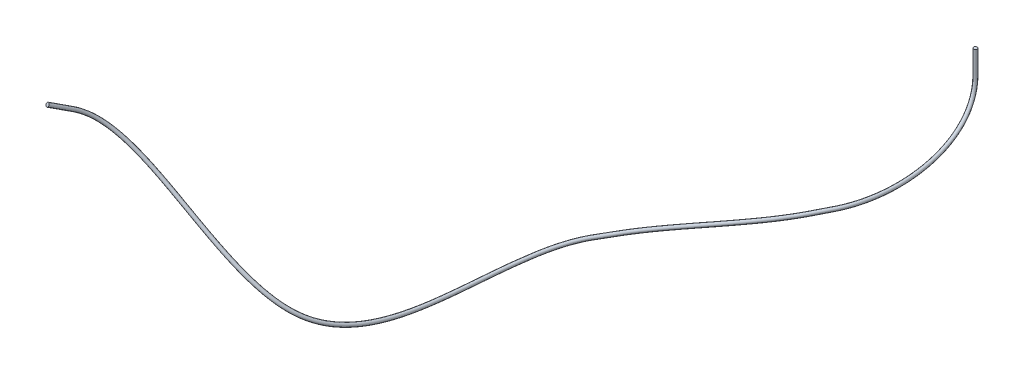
ISO-10303-21;
HEADER;
FILE_DESCRIPTION(('STEP AP214'),'2;1');
FILE_NAME('part.step','',(''),(''),'','','');
FILE_SCHEMA(('AUTOMOTIVE_DESIGN { 1 0 10303 214 1 1 1 1 }'));
ENDSEC;
DATA;
#1=APPLICATION_CONTEXT('core data for automotive mechanical design processes');
#2=APPLICATION_PROTOCOL_DEFINITION('international standard','automotive_design',2000,#1);
#3=PRODUCT_CONTEXT('',#1,'mechanical');
#4=PRODUCT('Part','Part','',(#3));
#5=PRODUCT_RELATED_PRODUCT_CATEGORY('part','',(#4));
#6=PRODUCT_DEFINITION_FORMATION('','',#4);
#7=PRODUCT_DEFINITION_CONTEXT('part definition',#1,'design');
#8=PRODUCT_DEFINITION('design','',#6,#7);
#9=PRODUCT_DEFINITION_SHAPE('','',#8);
#10=(LENGTH_UNIT() NAMED_UNIT(*) SI_UNIT(.MILLI.,.METRE.));
#11=(NAMED_UNIT(*) PLANE_ANGLE_UNIT() SI_UNIT($,.RADIAN.));
#12=(NAMED_UNIT(*) SI_UNIT($,.STERADIAN.) SOLID_ANGLE_UNIT());
#13=UNCERTAINTY_MEASURE_WITH_UNIT(LENGTH_MEASURE(1.E-05),#10,'distance_accuracy_value','');
#14=(GEOMETRIC_REPRESENTATION_CONTEXT(3) GLOBAL_UNCERTAINTY_ASSIGNED_CONTEXT((#13)) GLOBAL_UNIT_ASSIGNED_CONTEXT((#10,
#11,#12)) REPRESENTATION_CONTEXT('',''));
#15=CARTESIAN_POINT('',(0.,0.,0.));
#16=DIRECTION('',(0.,0.,1.));
#17=DIRECTION('',(1.,0.,0.));
#18=AXIS2_PLACEMENT_3D('',#15,#16,#17);
#19=CARTESIAN_POINT('',(129.032,35.2425,13.3985));
#20=DIRECTION('',(0.,-1.,0.));
#21=DIRECTION('',(1.,0.,0.));
#22=AXIS2_PLACEMENT_3D('',#19,#20,#21);
#23=PLANE('',#22);
#24=CARTESIAN_POINT('',(129.845000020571,35.2425,13.3985));
#25=CARTESIAN_POINT('',(129.845000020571,35.2425,13.8241858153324));
#26=CARTESIAN_POINT('',(129.457685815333,35.2425,14.2115000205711));
#27=CARTESIAN_POINT('',(128.606314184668,35.2425,14.2115000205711));
#28=CARTESIAN_POINT('',(128.218999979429,35.2425,13.8241858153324));
#29=CARTESIAN_POINT('',(128.218999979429,35.2425,12.9728141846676));
#30=CARTESIAN_POINT('',(128.606314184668,35.2425,12.585499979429));
#31=CARTESIAN_POINT('',(129.457685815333,35.2425,12.585499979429));
#32=CARTESIAN_POINT('',(129.845000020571,35.2425,12.9728141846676));
#33=CARTESIAN_POINT('',(129.845000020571,35.2425,13.3985));
#34=B_SPLINE_CURVE_WITH_KNOTS('',3,(#24,#25,#26,#27,#28,#29,#30,#31,#32,#33),.UNSPECIFIED.,.T.,
.F.,(4,2,2,2,4),(0.,0.25,0.5,0.75,1.),.UNSPECIFIED.);
#35=CARTESIAN_POINT('',(129.845000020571,35.2425,13.3985));
#36=VERTEX_POINT('',#35);
#37=EDGE_CURVE('E24',#36,#36,#34,.T.);
#38=ORIENTED_EDGE('',*,*,#37,.F.);
#39=EDGE_LOOP('',(#38));
#40=FACE_BOUND('',#39,.T.);
#41=ADVANCED_FACE('F14',(#40),#23,.F.);
#42=CARTESIAN_POINT('',(-8.90778368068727,81.1206105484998,286.540515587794));
#43=DIRECTION('',(-0.27533615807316,0.453990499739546,0.847397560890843));
#44=DIRECTION('',(0.892316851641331,0.448681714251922,0.049551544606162));
#45=AXIS2_PLACEMENT_3D('',#42,#43,#44);
#46=PLANE('',#45);
#47=CARTESIAN_POINT('',(-8.18233006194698,81.4853887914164,286.580800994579));
#48=CARTESIAN_POINT('',(-8.03005549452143,81.1576999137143,286.805836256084));
#49=CARTESIAN_POINT('',(-8.23711405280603,80.6857683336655,286.991394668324));
#50=CARTESIAN_POINT('',(-8.99680730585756,80.3037734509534,286.949207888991));
#51=CARTESIAN_POINT('',(-9.48096273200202,80.428143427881,286.725265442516));
#52=CARTESIAN_POINT('',(-9.78551186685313,81.0835211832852,286.275194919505));
#53=CARTESIAN_POINT('',(-9.57845330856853,81.555452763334,286.089636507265));
#54=CARTESIAN_POINT('',(-8.818760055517,81.9374476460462,286.131823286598));
#55=CARTESIAN_POINT('',(-8.33460462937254,81.8130776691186,286.355765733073));
#56=CARTESIAN_POINT('',(-8.18233006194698,81.4853887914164,286.580800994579));
#57=B_SPLINE_CURVE_WITH_KNOTS('',3,(#47,#48,#49,#50,#51,#52,#53,#54,#55,#56),.UNSPECIFIED.,.T.,
.F.,(4,2,2,2,4),(0.,0.25,0.5,0.75,1.),.UNSPECIFIED.);
#58=CARTESIAN_POINT('',(-8.18233006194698,81.4853887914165,286.580800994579));
#59=VERTEX_POINT('',#58);
#60=EDGE_CURVE('E9',#59,#59,#57,.F.);
#61=ORIENTED_EDGE('',*,*,#60,.T.);
#62=EDGE_LOOP('',(#61));
#63=FACE_BOUND('',#62,.T.);
#64=ADVANCED_FACE('F32',(#63),#46,.T.);
#65=CARTESIAN_POINT('',(129.845000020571,35.2425,13.3985));
#66=CARTESIAN_POINT('',(129.845000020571,31.9184242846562,13.3984999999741));
#67=CARTESIAN_POINT('',(129.844990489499,28.5696958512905,13.3918134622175));
#68=CARTESIAN_POINT('',(129.845017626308,19.0748861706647,13.4108513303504));
#69=CARTESIAN_POINT('',(130.49475792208,14.8275689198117,15.9784224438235));
#70=CARTESIAN_POINT('',(132.105649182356,8.80960138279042,24.3035892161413));
#71=CARTESIAN_POINT('',(133.010800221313,7.18038857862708,30.1169549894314));
#72=CARTESIAN_POINT('',(135.001109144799,4.14185856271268,49.4901921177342));
#73=CARTESIAN_POINT('',(135.116356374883,5.22004630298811,65.4572993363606));
#74=CARTESIAN_POINT('',(128.424413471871,5.22006576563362,78.59125511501));
#75=CARTESIAN_POINT('',(127.2657524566,5.22006243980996,80.8652239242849));
#76=CARTESIAN_POINT('',(116.737003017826,5.22006243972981,101.528911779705));
#77=CARTESIAN_POINT('',(101.124111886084,5.22006243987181,116.238828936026));
#78=CARTESIAN_POINT('',(89.7231080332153,5.22006243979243,135.985832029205));
#79=CARTESIAN_POINT('',(88.3400788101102,5.22006540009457,138.381294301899));
#80=CARTESIAN_POINT('',(82.9193495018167,5.22005173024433,147.770398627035));
#81=CARTESIAN_POINT('',(80.5722551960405,4.68791333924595,156.781916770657));
#82=CARTESIAN_POINT('',(77.226078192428,3.74845837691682,176.103929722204));
#83=CARTESIAN_POINT('',(76.2758880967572,3.33780127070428,186.368311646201));
#84=CARTESIAN_POINT('',(72.9926770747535,3.72042020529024,215.791848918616));
#85=CARTESIAN_POINT('',(70.2545285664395,6.05190228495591,233.86201570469));
#86=CARTESIAN_POINT('',(52.3359544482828,21.3263417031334,253.301847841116));
#87=CARTESIAN_POINT('',(38.4651258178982,33.1595884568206,255.867974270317));
#88=CARTESIAN_POINT('',(18.4463804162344,51.3709551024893,260.432166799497));
#89=CARTESIAN_POINT('',(11.9227226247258,57.5052890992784,262.066213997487));
#90=CARTESIAN_POINT('',(1.03209247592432,68.5653372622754,267.679776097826));
#91=CARTESIAN_POINT('',(-3.31142291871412,73.4539993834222,271.589896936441));
#92=CARTESIAN_POINT('',(-6.27504136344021,78.3405187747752,280.710687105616));
#93=CARTESIAN_POINT('',(-7.26828583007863,79.9782587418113,283.767662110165));
#94=CARTESIAN_POINT('',(-8.18233006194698,81.4853887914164,286.580800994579));
#95=CARTESIAN_POINT('',(129.845000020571,35.2425,13.8241858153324));
#96=CARTESIAN_POINT('',(129.845000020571,31.9424380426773,13.8241858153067));
#97=CARTESIAN_POINT('',(129.848472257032,28.5377223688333,13.8175000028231));
#98=CARTESIAN_POINT('',(129.838586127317,19.1339473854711,13.8365358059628));
#99=CARTESIAN_POINT('',(130.448811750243,15.100010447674,16.3196697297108));
#100=CARTESIAN_POINT('',(131.975836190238,9.19059091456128,24.4790335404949));
#101=CARTESIAN_POINT('',(132.783944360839,7.52293417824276,30.2354749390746));
#102=CARTESIAN_POINT('',(134.752976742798,4.49710087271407,49.4897885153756));
#103=CARTESIAN_POINT('',(134.885719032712,5.5719131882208,65.3822335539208));
#104=CARTESIAN_POINT('',(128.214485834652,5.57193256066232,78.4755426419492));
#105=CARTESIAN_POINT('',(127.050708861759,5.57192925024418,80.7595523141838));
#106=CARTESIAN_POINT('',(116.536307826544,5.57192925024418,101.395080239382));
#107=CARTESIAN_POINT('',(100.928958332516,5.57192925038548,116.097686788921));
#108=CARTESIAN_POINT('',(89.5141041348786,5.57192925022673,135.868679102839));
#109=CARTESIAN_POINT('',(88.1369578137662,5.57193223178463,138.253951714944));
#110=CARTESIAN_POINT('',(82.6960923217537,5.57191846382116,147.677933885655));
#111=CARTESIAN_POINT('',(80.3316317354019,5.03733056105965,156.745029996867));
#112=CARTESIAN_POINT('',(76.9813776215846,4.09673843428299,176.090689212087));
#113=CARTESIAN_POINT('',(76.0319392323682,3.68662327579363,186.352156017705));
#114=CARTESIAN_POINT('',(72.7539464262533,4.06868308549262,215.729472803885));
#115=CARTESIAN_POINT('',(70.0105554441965,6.40800215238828,233.673722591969));
#116=CARTESIAN_POINT('',(52.3172313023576,21.4904303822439,252.869181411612));
#117=CARTESIAN_POINT('',(38.4927174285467,33.2825705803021,255.461329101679));
#118=CARTESIAN_POINT('',(18.4672404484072,51.5000483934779,260.027052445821));
#119=CARTESIAN_POINT('',(11.9301595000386,57.646043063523,261.661661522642));
#120=CARTESIAN_POINT('',(0.975934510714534,68.7706447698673,267.307990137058));
#121=CARTESIAN_POINT('',(-3.44680870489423,73.7538418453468,271.312886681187));
#122=CARTESIAN_POINT('',(-6.43408728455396,78.6793723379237,280.506490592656));
#123=CARTESIAN_POINT('',(-7.41547502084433,80.2975625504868,283.526975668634));
#124=CARTESIAN_POINT('',(-8.33460462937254,81.8130776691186,286.355765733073));
#125=CARTESIAN_POINT('',(129.457685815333,35.2425,14.2115000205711));
#126=CARTESIAN_POINT('',(129.457685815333,31.9586799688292,14.2115000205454));
#127=CARTESIAN_POINT('',(129.46432591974,28.5160968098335,14.2079824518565));
#128=CARTESIAN_POINT('',(129.445420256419,19.1738939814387,14.2179976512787));
#129=CARTESIAN_POINT('',(130.02414867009,15.2802170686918,16.6251972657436));
#130=CARTESIAN_POINT('',(131.492454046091,9.40403703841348,24.6431758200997));
#131=CARTESIAN_POINT('',(132.253892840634,7.62182511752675,30.3365923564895));
#132=CARTESIAN_POINT('',(134.210963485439,4.59649247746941,49.4999979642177));
#133=CARTESIAN_POINT('',(134.357794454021,5.67407940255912,65.2330089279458));
#134=CARTESIAN_POINT('',(127.744990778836,5.6740985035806,78.211638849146));
#135=CARTESIAN_POINT('',(126.567686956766,5.67409523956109,80.5221971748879));
#136=CARTESIAN_POINT('',(116.085514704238,5.67409523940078,101.094473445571));
#137=CARTESIAN_POINT('',(100.490612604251,5.67409523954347,115.780659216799));
#138=CARTESIAN_POINT('',(89.0446483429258,5.67409523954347,135.605535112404));
#139=CARTESIAN_POINT('',(87.6786529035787,5.67409825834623,137.971493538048));
#140=CARTESIAN_POINT('',(82.2020849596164,5.6740843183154,147.457315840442));
#141=CARTESIAN_POINT('',(79.8046506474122,5.13496636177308,156.628064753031));
#142=CARTESIAN_POINT('',(76.4441852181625,4.19153349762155,176.032715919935));
#143=CARTESIAN_POINT('',(75.4948613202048,3.78174627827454,186.300954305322));
#144=CARTESIAN_POINT('',(72.2201798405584,4.16351517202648,215.648744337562));
#145=CARTESIAN_POINT('',(69.4672635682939,6.51513120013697,233.455123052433));
#146=CARTESIAN_POINT('',(52.0347622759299,21.3752246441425,252.367615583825));
#147=CARTESIAN_POINT('',(38.261190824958,33.1219574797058,254.991355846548));
#148=CARTESIAN_POINT('',(18.2183591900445,51.3552085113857,259.561040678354));
#149=CARTESIAN_POINT('',(11.6614365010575,57.5186089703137,261.196961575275));
#150=CARTESIAN_POINT('',(0.619934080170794,68.7318109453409,266.888284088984));
#151=CARTESIAN_POINT('',(-3.90856645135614,73.8412822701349,271.020015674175));
#152=CARTESIAN_POINT('',(-6.92722279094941,78.8185487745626,280.310184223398));
#153=CARTESIAN_POINT('',(-7.89288628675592,80.4108123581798,283.28227683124));
#154=CARTESIAN_POINT('',(-8.818760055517,81.9374476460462,286.131823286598));
#155=CARTESIAN_POINT('',(128.606314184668,35.2425,14.2115000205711));
#156=CARTESIAN_POINT('',(128.606314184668,31.9463545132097,14.2115000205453));
#157=CARTESIAN_POINT('',(128.612954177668,28.5325077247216,14.2149452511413));
#158=CARTESIAN_POINT('',(128.594048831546,19.1435798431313,14.2051360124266));
#159=CARTESIAN_POINT('',(129.182571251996,15.131453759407,16.6142956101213));
#160=CARTESIAN_POINT('',(130.689537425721,9.11124286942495,24.653095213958));
#161=CARTESIAN_POINT('',(131.542476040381,7.15411024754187,30.3218229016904));
#162=CARTESIAN_POINT('',(133.515806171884,4.10448472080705,49.5232469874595));
#163=CARTESIAN_POINT('',(133.658615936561,5.19492148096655,65.0551235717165));
#164=CARTESIAN_POINT('',(127.132829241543,5.19494016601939,77.8629657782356));
#165=CARTESIAN_POINT('',(125.936023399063,5.19493697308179,80.2118000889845));
#166=CARTESIAN_POINT('',(115.495997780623,5.19493697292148,100.701360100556));
#167=CARTESIAN_POINT('',(99.9173735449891,5.19493697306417,115.366071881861));
#168=CARTESIAN_POINT('',(88.4307256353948,5.19493697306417,135.261413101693));
#169=CARTESIAN_POINT('',(87.0774756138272,5.19494003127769,137.605295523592));
#170=CARTESIAN_POINT('',(81.5627009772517,5.19492590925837,147.157295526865));
#171=CARTESIAN_POINT('',(79.1275182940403,4.65074927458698,156.444732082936));
#172=CARTESIAN_POINT('',(75.7527611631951,3.70334639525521,175.931763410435));
#173=CARTESIAN_POINT('',(74.802185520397,3.29319613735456,186.220716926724));
#174=CARTESIAN_POINT('',(71.5243463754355,3.67544380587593,215.596043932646));
#175=CARTESIAN_POINT('',(68.7609771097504,6.03841632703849,233.351196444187));
#176=CARTESIAN_POINT('',(51.4513015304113,20.7938087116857,252.13043551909));
#177=CARTESIAN_POINT('',(37.6970792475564,32.5229428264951,254.771578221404));
#178=CARTESIAN_POINT('',(17.6295627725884,50.778643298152,259.346909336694));
#179=CARTESIAN_POINT('',(11.0558714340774,56.9569828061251,260.98459004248));
#180=CARTESIAN_POINT('',(-0.0502894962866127,68.2358336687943,266.709282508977));
#181=CARTESIAN_POINT('',(-4.65280398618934,73.4338038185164,270.930264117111));
#182=CARTESIAN_POINT('',(-7.69311282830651,78.4467712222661,280.287067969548));
#183=CARTESIAN_POINT('',(-8.64792567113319,80.0211439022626,283.225766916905));
#184=CARTESIAN_POINT('',(-9.57845330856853,81.555452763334,286.089636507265));
#185=CARTESIAN_POINT('',(128.218999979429,35.2425,13.8241858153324));
#186=CARTESIAN_POINT('',(128.218999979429,31.9188981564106,13.8241858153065));
#187=CARTESIAN_POINT('',(128.222472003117,28.5690649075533,13.8307979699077));
#188=CARTESIAN_POINT('',(128.212586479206,19.0760516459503,13.8119718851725));
#189=CARTESIAN_POINT('',(128.841517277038,14.8158934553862,16.2988491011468));
#190=CARTESIAN_POINT('',(130.442378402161,8.63139524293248,24.4979781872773));
#191=CARTESIAN_POINT('',(131.425238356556,6.62966457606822,30.207267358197));
#192=CARTESIAN_POINT('',(133.425324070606,3.5574352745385,49.5341908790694));
#193=CARTESIAN_POINT('',(133.550386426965,4.65678896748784,65.0424975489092));
#194=CARTESIAN_POINT('',(127.045343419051,4.65680754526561,77.8096261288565));
#195=CARTESIAN_POINT('',(125.844320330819,4.65680437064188,80.1667375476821));
#196=CARTESIAN_POINT('',(115.410413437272,4.65680437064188,100.644289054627));
#197=CARTESIAN_POINT('',(99.8341523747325,4.65680437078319,115.305883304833));
#198=CARTESIAN_POINT('',(88.3415981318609,4.65680437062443,135.211454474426));
#199=CARTESIAN_POINT('',(86.9887937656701,4.65680742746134,137.554565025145));
#200=CARTESIAN_POINT('',(81.4749588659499,4.65679331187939,147.1049372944));
#201=CARTESIAN_POINT('',(79.0384042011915,4.11254404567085,156.394890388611));
#202=CARTESIAN_POINT('',(75.6608549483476,3.16436974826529,175.897884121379));
#203=CARTESIAN_POINT('',(74.7090259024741,2.75356123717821,186.198913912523));
#204=CARTESIAN_POINT('',(71.4250023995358,3.13653543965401,215.628822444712));
#205=CARTESIAN_POINT('',(68.6616476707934,5.497543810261,233.475237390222));
#206=CARTESIAN_POINT('',(51.2029033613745,20.3800077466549,252.416200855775));
#207=CARTESIAN_POINT('',(37.4153436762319,32.1385368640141,255.04158475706));
#208=CARTESIAN_POINT('',(17.3427221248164,50.3988899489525,259.618091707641));
#209=CARTESIAN_POINT('',(10.7736154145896,56.5734161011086,261.256061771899));
#210=CARTESIAN_POINT('',(-0.304098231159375,67.8233979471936,266.966122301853));
#211=CARTESIAN_POINT('',(-4.86819769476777,72.9756153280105,271.141473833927));
#212=CARTESIAN_POINT('',(-7.89682950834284,77.9693295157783,280.462341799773));
#213=CARTESIAN_POINT('',(-8.85749402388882,79.5533506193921,283.41904968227));
#214=CARTESIAN_POINT('',(-9.78551186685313,81.0835211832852,286.275194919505));
#215=CARTESIAN_POINT('',(128.218999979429,35.2425,12.9728141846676));
#216=CARTESIAN_POINT('',(128.218999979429,31.8708706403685,12.9728141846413));
#217=CARTESIAN_POINT('',(128.215508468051,28.6330118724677,12.9794248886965));
#218=CARTESIAN_POINT('',(128.22544947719,18.9579292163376,12.9606029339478));
#219=CARTESIAN_POINT('',(128.933409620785,14.2710103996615,15.6163545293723));
#220=CARTESIAN_POINT('',(130.702004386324,7.86941617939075,24.1470895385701));
#221=CARTESIAN_POINT('',(131.878950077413,5.94457337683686,29.9702274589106));
#222=CARTESIAN_POINT('',(133.921588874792,2.84695065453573,49.5349980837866));
#223=CARTESIAN_POINT('',(134.011661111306,3.95305519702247,65.1926291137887));
#224=CARTESIAN_POINT('',(127.46519869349,3.95307395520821,78.0410510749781));
#225=CARTESIAN_POINT('',(126.274407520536,3.95307074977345,80.3780807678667));
#226=CARTESIAN_POINT('',(115.81180381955,3.95307074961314,100.911952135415));
#227=CARTESIAN_POINT('',(100.224459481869,3.95307074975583,115.588167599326));
#228=CARTESIAN_POINT('',(88.7596059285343,3.95307074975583,135.445760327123));
#229=CARTESIAN_POINT('',(87.3950357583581,3.95307376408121,137.809250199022));
#230=CARTESIAN_POINT('',(81.921473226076,3.95305984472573,147.289866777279));
#231=CARTESIAN_POINT('',(79.5196511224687,3.41370960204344,156.468663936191));
#232=CARTESIAN_POINT('',(76.1502560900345,2.46780963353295,175.924365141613));
#233=CARTESIAN_POINT('',(75.1969236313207,2.05591722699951,186.231225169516));
#234=CARTESIAN_POINT('',(71.9024636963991,2.44000967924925,215.753574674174));
#235=CARTESIAN_POINT('',(69.1495939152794,4.78534407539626,233.851823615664));
#236=CARTESIAN_POINT('',(51.2403496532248,20.0518303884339,253.281533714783));
#237=CARTESIAN_POINT('',(37.3601604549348,31.8925726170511,255.854875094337));
#238=CARTESIAN_POINT('',(17.301002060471,50.1407033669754,260.428320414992));
#239=CARTESIAN_POINT('',(10.758741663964,56.2919081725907,262.065166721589));
#240=CARTESIAN_POINT('',(-0.19178230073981,67.4127829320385,267.709694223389));
#241=CARTESIAN_POINT('',(-4.59742612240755,72.3759304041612,271.695494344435));
#242=CARTESIAN_POINT('',(-7.57873766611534,77.2916223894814,280.870734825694));
#243=CARTESIAN_POINT('',(-8.56311564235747,78.9147430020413,283.900422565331));
#244=CARTESIAN_POINT('',(-9.48096273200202,80.428143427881,286.725265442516));
#245=CARTESIAN_POINT('',(128.606314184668,35.2425,12.585499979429));
#246=CARTESIAN_POINT('',(128.606314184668,31.8546287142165,12.5854999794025));
#247=CARTESIAN_POINT('',(128.599654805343,28.6546374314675,12.5889424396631));
#248=CARTESIAN_POINT('',(128.618615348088,18.9179826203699,12.5791410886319));
#249=CARTESIAN_POINT('',(129.358072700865,14.0908037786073,15.3108269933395));
#250=CARTESIAN_POINT('',(131.185386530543,7.65597005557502,23.9829472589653));
#251=CARTESIAN_POINT('',(132.409001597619,5.84568243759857,29.8691100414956));
#252=CARTESIAN_POINT('',(134.463602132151,2.74755904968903,49.5247886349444));
#253=CARTESIAN_POINT('',(134.539585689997,3.85088898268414,65.34185373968));
#254=CARTESIAN_POINT('',(127.934693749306,3.85090801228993,78.3049548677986));
#255=CARTESIAN_POINT('',(126.757429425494,3.85090476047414,80.6154359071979));
#256=CARTESIAN_POINT('',(116.262596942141,3.85090476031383,101.212558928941));
#257=CARTESIAN_POINT('',(100.662805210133,3.85090476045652,115.905195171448));
#258=CARTESIAN_POINT('',(89.2290617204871,3.85090476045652,135.708904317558));
#259=CARTESIAN_POINT('',(87.8533406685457,3.85090773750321,138.091708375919));
#260=CARTESIAN_POINT('',(82.4154805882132,3.85089399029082,147.510484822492));
#261=CARTESIAN_POINT('',(80.0466322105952,3.31607380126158,156.58562917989));
#262=CARTESIAN_POINT('',(76.6874484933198,2.37301457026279,175.982338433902));
#263=CARTESIAN_POINT('',(75.7340015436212,1.96079422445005,186.282426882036));
#264=CARTESIAN_POINT('',(72.4362302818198,2.34517759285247,215.834303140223));
#265=CARTESIAN_POINT('',(69.6928857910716,4.67821502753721,234.0704231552));
#266=CARTESIAN_POINT('',(51.5228186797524,20.1670361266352,253.78309954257));
#267=CARTESIAN_POINT('',(37.5916870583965,32.0531857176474,256.324848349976));
#268=CARTESIAN_POINT('',(17.5498833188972,50.2855432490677,260.894332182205));
#269=CARTESIAN_POINT('',(11.0274646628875,56.4193422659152,262.529866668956));
#270=CARTESIAN_POINT('',(0.164218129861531,67.4516167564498,268.129400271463));
#271=CARTESIAN_POINT('',(-4.13566837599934,72.2884899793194,271.988365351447));
#272=CARTESIAN_POINT('',(-7.08560215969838,77.152445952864,281.067041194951));
#273=CARTESIAN_POINT('',(-8.08570437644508,78.801493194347,284.145121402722));
#274=CARTESIAN_POINT('',(-8.99680730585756,80.3037734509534,286.949207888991));
#275=CARTESIAN_POINT('',(129.457685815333,35.2425,12.585499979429));
#276=CARTESIAN_POINT('',(129.457685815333,31.8669541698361,12.5854999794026));
#277=CARTESIAN_POINT('',(129.451026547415,28.6382265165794,12.5819796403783));
#278=CARTESIAN_POINT('',(129.46998677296,18.9482967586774,12.592002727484));
#279=CARTESIAN_POINT('',(130.199650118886,14.2395670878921,15.3217286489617));
#280=CARTESIAN_POINT('',(131.988303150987,7.94876422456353,23.973027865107));
#281=CARTESIAN_POINT('',(133.120418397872,6.31339730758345,29.8838794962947));
#282=CARTESIAN_POINT('',(135.158759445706,3.23956680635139,49.5015396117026));
#283=CARTESIAN_POINT('',(135.23876420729,4.33004690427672,65.519739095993));
#284=CARTESIAN_POINT('',(128.546855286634,4.33006634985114,78.6536279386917));
#285=CARTESIAN_POINT('',(127.389092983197,4.33006302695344,80.925832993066));
#286=CARTESIAN_POINT('',(116.852113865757,4.33006302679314,101.605672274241));
#287=CARTESIAN_POINT('',(101.236044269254,4.33006302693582,116.319782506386));
#288=CARTESIAN_POINT('',(89.8429844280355,4.33006302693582,136.053026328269));
#289=CARTESIAN_POINT('',(88.4545179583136,4.33006596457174,138.457906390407));
#290=CARTESIAN_POINT('',(83.0548645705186,4.33005239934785,147.810505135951));
#291=CARTESIAN_POINT('',(80.7237645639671,3.80029088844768,156.768961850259));
#292=CARTESIAN_POINT('',(77.3788725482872,2.86120167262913,176.083290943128));
#293=CARTESIAN_POINT('',(76.4266773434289,2.44934436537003,186.362664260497));
#294=CARTESIAN_POINT('',(73.1320637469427,2.83324895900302,215.887003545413));
#295=CARTESIAN_POINT('',(70.3991722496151,5.15492990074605,234.174349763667));
#296=CARTESIAN_POINT('',(52.1062794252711,20.7484520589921,254.020279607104));
#297=CARTESIAN_POINT('',(38.155798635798,32.6522003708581,256.544625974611));
#298=CARTESIAN_POINT('',(18.1386797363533,50.8621084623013,261.10846352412));
#299=CARTESIAN_POINT('',(11.6330297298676,56.9809684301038,262.742238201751));
#300=CARTESIAN_POINT('',(0.834441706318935,67.9475940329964,268.30840185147));
#301=CARTESIAN_POINT('',(-3.39143084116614,72.6959684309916,272.078116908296));
#302=CARTESIAN_POINT('',(-6.31971212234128,77.5242235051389,281.090157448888));
#303=CARTESIAN_POINT('',(-7.33066499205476,79.1911616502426,284.201631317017));
#304=CARTESIAN_POINT('',(-8.23711405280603,80.6857683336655,286.991394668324));
#305=CARTESIAN_POINT('',(129.845000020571,35.2425,12.9728141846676));
#306=CARTESIAN_POINT('',(129.845000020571,31.8944105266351,12.9728141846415));
#307=CARTESIAN_POINT('',(129.841508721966,28.6016693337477,12.9661269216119));
#308=CARTESIAN_POINT('',(129.8514491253,19.0158249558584,12.9851668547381));
#309=CARTESIAN_POINT('',(130.540704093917,14.5551273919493,15.6371751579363));
#310=CARTESIAN_POINT('',(132.235462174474,8.42861185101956,24.1281448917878));
#311=CARTESIAN_POINT('',(133.237656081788,6.83784297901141,29.9984350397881));
#312=CARTESIAN_POINT('',(135.249241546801,3.7866162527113,49.4905957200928));
#313=CARTESIAN_POINT('',(135.346993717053,4.86817941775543,65.5323651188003));
#314=CARTESIAN_POINT('',(128.634341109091,4.86819897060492,78.7069675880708));
#315=CARTESIAN_POINT('',(127.480796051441,4.86819562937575,80.9708955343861));
#316=CARTESIAN_POINT('',(116.937698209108,4.86819562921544,101.662743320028));
#317=CARTESIAN_POINT('',(101.319265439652,4.86819562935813,116.379971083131));
#318=CARTESIAN_POINT('',(89.932111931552,4.86819562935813,136.102984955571));
#319=CARTESIAN_POINT('',(88.5431998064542,4.8681985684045,138.508636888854));
#320=CARTESIAN_POINT('',(83.1426066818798,4.86818499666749,147.862863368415));
#321=CARTESIAN_POINT('',(80.8128786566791,4.33849611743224,156.818803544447));
#322=CARTESIAN_POINT('',(77.4707787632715,3.40017831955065,176.117170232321));
#323=CARTESIAN_POINT('',(76.5198369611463,2.98897926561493,186.384467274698));
#324=CARTESIAN_POINT('',(73.2314077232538,3.37215732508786,215.854225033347));
#325=CARTESIAN_POINT('',(70.4985016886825,5.69580241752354,234.050308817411));
#326=CARTESIAN_POINT('',(52.354677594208,21.162253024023,253.734514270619));
#327=CARTESIAN_POINT('',(38.4375342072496,33.0366063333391,256.274619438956));
#328=CARTESIAN_POINT('',(18.4255203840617,51.2418618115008,260.837281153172));
#329=CARTESIAN_POINT('',(11.9152857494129,57.3645351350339,262.470766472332));
#330=CARTESIAN_POINT('',(1.0882504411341,68.3600297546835,268.051562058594));
#331=CARTESIAN_POINT('',(-3.17603713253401,73.1541569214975,271.866907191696));
#332=CARTESIAN_POINT('',(-6.11599544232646,78.0016652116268,280.914883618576));
#333=CARTESIAN_POINT('',(-7.12109663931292,79.6589549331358,284.008348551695));
#334=CARTESIAN_POINT('',(-8.03005549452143,81.1576999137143,286.805836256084));
#335=CARTESIAN_POINT('',(129.845000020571,35.2425,13.3985));
#336=CARTESIAN_POINT('',(129.845000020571,31.9184242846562,13.3984999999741));
#337=CARTESIAN_POINT('',(129.844990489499,28.5696958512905,13.3918134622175));
#338=CARTESIAN_POINT('',(129.845017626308,19.0748861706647,13.4108513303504));
#339=CARTESIAN_POINT('',(130.49475792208,14.8275689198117,15.9784224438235));
#340=CARTESIAN_POINT('',(132.105649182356,8.80960138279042,24.3035892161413));
#341=CARTESIAN_POINT('',(133.010800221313,7.18038857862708,30.1169549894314));
#342=CARTESIAN_POINT('',(135.001109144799,4.14185856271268,49.4901921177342));
#343=CARTESIAN_POINT('',(135.116356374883,5.22004630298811,65.4572993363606));
#344=CARTESIAN_POINT('',(128.424413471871,5.22006576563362,78.59125511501));
#345=CARTESIAN_POINT('',(127.2657524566,5.22006243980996,80.8652239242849));
#346=CARTESIAN_POINT('',(116.737003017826,5.22006243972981,101.528911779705));
#347=CARTESIAN_POINT('',(101.124111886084,5.22006243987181,116.238828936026));
#348=CARTESIAN_POINT('',(89.7231080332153,5.22006243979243,135.985832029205));
#349=CARTESIAN_POINT('',(88.3400788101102,5.22006540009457,138.381294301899));
#350=CARTESIAN_POINT('',(82.9193495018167,5.22005173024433,147.770398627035));
#351=CARTESIAN_POINT('',(80.5722551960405,4.68791333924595,156.781916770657));
#352=CARTESIAN_POINT('',(77.226078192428,3.74845837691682,176.103929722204));
#353=CARTESIAN_POINT('',(76.2758880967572,3.33780127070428,186.368311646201));
#354=CARTESIAN_POINT('',(72.9926770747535,3.72042020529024,215.791848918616));
#355=CARTESIAN_POINT('',(70.2545285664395,6.05190228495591,233.86201570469));
#356=CARTESIAN_POINT('',(52.3359544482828,21.3263417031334,253.301847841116));
#357=CARTESIAN_POINT('',(38.4651258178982,33.1595884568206,255.867974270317));
#358=CARTESIAN_POINT('',(18.4463804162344,51.3709551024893,260.432166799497));
#359=CARTESIAN_POINT('',(11.9227226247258,57.5052890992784,262.066213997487));
#360=CARTESIAN_POINT('',(1.03209247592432,68.5653372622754,267.679776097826));
#361=CARTESIAN_POINT('',(-3.31142291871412,73.4539993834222,271.589896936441));
#362=CARTESIAN_POINT('',(-6.27504136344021,78.3405187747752,280.710687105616));
#363=CARTESIAN_POINT('',(-7.26828583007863,79.9782587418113,283.767662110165));
#364=CARTESIAN_POINT('',(-8.18233006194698,81.4853887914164,286.580800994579));
#365=B_SPLINE_SURFACE_WITH_KNOTS('',3,3,((#65,#66,#67,#68,#69,#70,#71,#72,#73,#74,#75,#76,#77,
#78,#79,#80,#81,#82,#83,#84,#85,#86,#87,#88,#89,#90,#91,#92,#93,#94),(#95,#96,#97,#98,#99,#100,
#101,#102,#103,#104,#105,#106,#107,#108,#109,#110,#111,#112,#113,#114,#115,#116,#117,#118,#119,
#120,#121,#122,#123,#124),(#125,#126,#127,#128,#129,#130,#131,#132,#133,#134,#135,#136,#137,
#138,#139,#140,#141,#142,#143,#144,#145,#146,#147,#148,#149,#150,#151,#152,#153,#154),(#155,
#156,#157,#158,#159,#160,#161,#162,#163,#164,#165,#166,#167,#168,#169,#170,#171,#172,#173,#174,
#175,#176,#177,#178,#179,#180,#181,#182,#183,#184),(#185,#186,#187,#188,#189,#190,#191,#192,
#193,#194,#195,#196,#197,#198,#199,#200,#201,#202,#203,#204,#205,#206,#207,#208,#209,#210,#211,
#212,#213,#214),(#215,#216,#217,#218,#219,#220,#221,#222,#223,#224,#225,#226,#227,#228,#229,
#230,#231,#232,#233,#234,#235,#236,#237,#238,#239,#240,#241,#242,#243,#244),(#245,#246,#247,
#248,#249,#250,#251,#252,#253,#254,#255,#256,#257,#258,#259,#260,#261,#262,#263,#264,#265,#266,
#267,#268,#269,#270,#271,#272,#273,#274),(#275,#276,#277,#278,#279,#280,#281,#282,#283,#284,
#285,#286,#287,#288,#289,#290,#291,#292,#293,#294,#295,#296,#297,#298,#299,#300,#301,#302,#303,
#304),(#305,#306,#307,#308,#309,#310,#311,#312,#313,#314,#315,#316,#317,#318,#319,#320,#321,
#322,#323,#324,#325,#326,#327,#328,#329,#330,#331,#332,#333,#334),(#335,#336,#337,#338,#339,
#340,#341,#342,#343,#344,#345,#346,#347,#348,#349,#350,#351,#352,#353,#354,#355,#356,#357,#358,
#359,#360,#361,#362,#363,#364)),.UNSPECIFIED.,.T.,.F.,.F.,(4,2,2,2,4),(4,2,2,2,2,2,2,2,2,2,2,2,
2,2,4),(0.,0.25,0.5,0.75,1.),(0.,0.0262653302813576,0.0747824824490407,0.123299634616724,
0.22033393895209,0.240332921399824,0.402292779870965,0.422291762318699,0.494642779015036,
0.566993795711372,0.711695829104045,0.842715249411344,0.908224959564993,0.973734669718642,1.),.UNSPECIFIED.);
#366=ORIENTED_EDGE('',*,*,#60,.F.);
#367=EDGE_LOOP('',(#366));
#368=FACE_BOUND('',#367,.T.);
#369=ORIENTED_EDGE('',*,*,#37,.T.);
#370=EDGE_LOOP('',(#369));
#371=FACE_BOUND('',#370,.T.);
#372=ADVANCED_FACE('F49',(#368,#371),#365,.T.);
#373=CLOSED_SHELL('',(#41,#64,#372));
#374=MANIFOLD_SOLID_BREP('B1',#373);
#375=ADVANCED_BREP_SHAPE_REPRESENTATION('',(#18,#374),#14);
#376=SHAPE_DEFINITION_REPRESENTATION(#9,#375);
ENDSEC;
END-ISO-10303-21;
